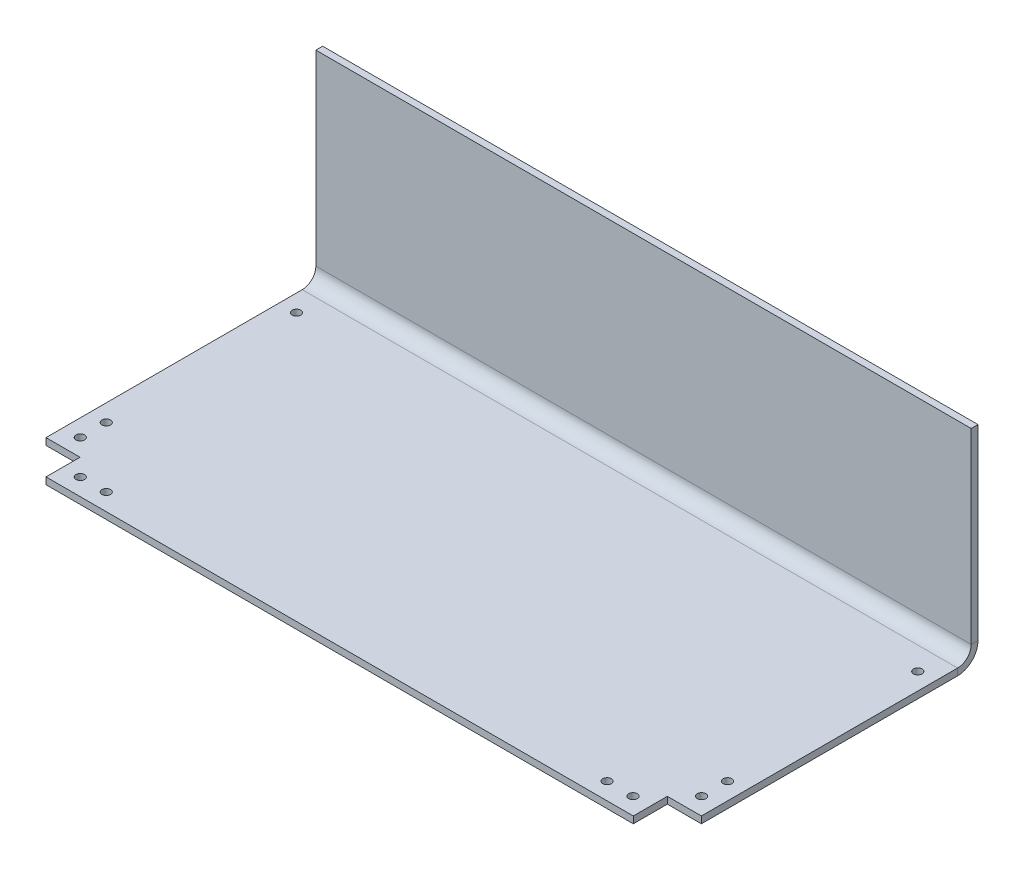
ISO-10303-21;
HEADER;
FILE_DESCRIPTION(('STEP AP214'),'2;1');
FILE_NAME('part.step','',(''),(''),'','','');
FILE_SCHEMA(('AUTOMOTIVE_DESIGN { 1 0 10303 214 1 1 1 1 }'));
ENDSEC;
DATA;
#1=APPLICATION_CONTEXT('core data for automotive mechanical design processes');
#2=APPLICATION_PROTOCOL_DEFINITION('international standard','automotive_design',2000,#1);
#3=PRODUCT_CONTEXT('',#1,'mechanical');
#4=PRODUCT('Part','Part','',(#3));
#5=PRODUCT_RELATED_PRODUCT_CATEGORY('part','',(#4));
#6=PRODUCT_DEFINITION_FORMATION('','',#4);
#7=PRODUCT_DEFINITION_CONTEXT('part definition',#1,'design');
#8=PRODUCT_DEFINITION('design','',#6,#7);
#9=PRODUCT_DEFINITION_SHAPE('','',#8);
#10=(LENGTH_UNIT() NAMED_UNIT(*) SI_UNIT(.MILLI.,.METRE.));
#11=(NAMED_UNIT(*) PLANE_ANGLE_UNIT() SI_UNIT($,.RADIAN.));
#12=(NAMED_UNIT(*) SI_UNIT($,.STERADIAN.) SOLID_ANGLE_UNIT());
#13=UNCERTAINTY_MEASURE_WITH_UNIT(LENGTH_MEASURE(1.E-05),#10,'distance_accuracy_value','');
#14=(GEOMETRIC_REPRESENTATION_CONTEXT(3) GLOBAL_UNCERTAINTY_ASSIGNED_CONTEXT((#13)) GLOBAL_UNIT_ASSIGNED_CONTEXT((#10,
#11,#12)) REPRESENTATION_CONTEXT('',''));
#15=CARTESIAN_POINT('',(0.,0.,0.));
#16=DIRECTION('',(0.,0.,1.));
#17=DIRECTION('',(1.,0.,0.));
#18=AXIS2_PLACEMENT_3D('',#15,#16,#17);
#19=CARTESIAN_POINT('',(0.,5.,228.2));
#20=DIRECTION('',(1.,0.,0.));
#21=DIRECTION('',(0.,0.,1.));
#22=AXIS2_PLACEMENT_3D('',#19,#20,#21);
#23=PLANE('',#22);
#24=DIRECTION('',(0.,0.,1.));
#25=VECTOR('',#24,1.);
#26=CARTESIAN_POINT('',(0.,5.,228.2));
#27=LINE('',#26,#25);
#28=CARTESIAN_POINT('',(0.,4.9999999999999,15.));
#29=VERTEX_POINT('',#28);
#30=CARTESIAN_POINT('',(0.,5.,203.2));
#31=VERTEX_POINT('',#30);
#32=EDGE_CURVE('E195',#29,#31,#27,.T.);
#33=ORIENTED_EDGE('',*,*,#32,.F.);
#34=DIRECTION('',(0.,-1.,0.));
#35=VECTOR('',#34,1.);
#36=CARTESIAN_POINT('',(0.,4.9999999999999,15.));
#37=LINE('',#36,#35);
#38=CARTESIAN_POINT('',(0.,-1.04083408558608E-13,15.));
#39=VERTEX_POINT('',#38);
#40=EDGE_CURVE('E319',#29,#39,#37,.T.);
#41=ORIENTED_EDGE('',*,*,#40,.T.);
#42=DIRECTION('',(0.,0.,-1.));
#43=VECTOR('',#42,1.);
#44=CARTESIAN_POINT('',(0.,0.,0.));
#45=LINE('',#44,#43);
#46=CARTESIAN_POINT('',(0.,0.,203.2));
#47=VERTEX_POINT('',#46);
#48=EDGE_CURVE('E262',#39,#47,#45,.F.);
#49=ORIENTED_EDGE('',*,*,#48,.T.);
#50=DIRECTION('',(0.,1.,0.));
#51=VECTOR('',#50,1.);
#52=CARTESIAN_POINT('',(0.,5.,203.2));
#53=LINE('',#52,#51);
#54=EDGE_CURVE('E80',#47,#31,#53,.T.);
#55=ORIENTED_EDGE('',*,*,#54,.T.);
#56=EDGE_LOOP('',(#33,#41,#49,#55));
#57=FACE_BOUND('',#56,.T.);
#58=ADVANCED_FACE('F71',(#57),#23,.F.);
#59=CARTESIAN_POINT('',(0.,5.,0.));
#60=DIRECTION('',(0.,-1.,0.));
#61=DIRECTION('',(0.,0.,-1.));
#62=AXIS2_PLACEMENT_3D('',#59,#60,#61);
#63=PLANE('',#62);
#64=CARTESIAN_POINT('',(56.75,5.,215.7));
#65=DIRECTION('',(0.,1.,0.));
#66=DIRECTION('',(0.,0.,-1.));
#67=AXIS2_PLACEMENT_3D('',#64,#65,#66);
#68=CIRCLE('',#67,3.17499999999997);
#69=CARTESIAN_POINT('',(56.75,5.,212.525));
#70=VERTEX_POINT('',#69);
#71=EDGE_CURVE('E289',#70,#70,#68,.T.);
#72=ORIENTED_EDGE('',*,*,#71,.F.);
#73=EDGE_LOOP('',(#72));
#74=FACE_BOUND('',#73,.T.);
#75=CARTESIAN_POINT('',(468.9,5.,31.75));
#76=DIRECTION('',(0.,1.,0.));
#77=DIRECTION('',(0.,0.,1.));
#78=AXIS2_PLACEMENT_3D('',#75,#76,#77);
#79=CIRCLE('',#78,3.17499999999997);
#80=CARTESIAN_POINT('',(468.9,5.,34.925));
#81=VERTEX_POINT('',#80);
#82=EDGE_CURVE('E351',#81,#81,#79,.T.);
#83=ORIENTED_EDGE('',*,*,#82,.F.);
#84=EDGE_LOOP('',(#83));
#85=FACE_BOUND('',#84,.T.);
#86=CARTESIAN_POINT('',(468.9,5.,190.5));
#87=DIRECTION('',(0.,1.,0.));
#88=DIRECTION('',(0.,0.,1.));
#89=AXIS2_PLACEMENT_3D('',#86,#87,#88);
#90=CIRCLE('',#89,3.17499999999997);
#91=CARTESIAN_POINT('',(468.9,5.,193.675));
#92=VERTEX_POINT('',#91);
#93=EDGE_CURVE('E347',#92,#92,#90,.T.);
#94=ORIENTED_EDGE('',*,*,#93,.F.);
#95=EDGE_LOOP('',(#94));
#96=FACE_BOUND('',#95,.T.);
#97=CARTESIAN_POINT('',(424.65,5.,215.7));
#98=DIRECTION('',(0.,1.,0.));
#99=DIRECTION('',(0.,0.,1.));
#100=AXIS2_PLACEMENT_3D('',#97,#98,#99);
#101=CIRCLE('',#100,3.17499999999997);
#102=CARTESIAN_POINT('',(424.65,5.,218.875));
#103=VERTEX_POINT('',#102);
#104=EDGE_CURVE('E343',#103,#103,#101,.T.);
#105=ORIENTED_EDGE('',*,*,#104,.F.);
#106=EDGE_LOOP('',(#105));
#107=FACE_BOUND('',#106,.T.);
#108=CARTESIAN_POINT('',(443.7,5.,215.7));
#109=DIRECTION('',(0.,1.,0.));
#110=DIRECTION('',(0.,0.,1.));
#111=AXIS2_PLACEMENT_3D('',#108,#109,#110);
#112=CIRCLE('',#111,3.17499999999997);
#113=CARTESIAN_POINT('',(443.7,5.,218.875));
#114=VERTEX_POINT('',#113);
#115=EDGE_CURVE('E339',#114,#114,#112,.T.);
#116=ORIENTED_EDGE('',*,*,#115,.F.);
#117=EDGE_LOOP('',(#116));
#118=FACE_BOUND('',#117,.T.);
#119=CARTESIAN_POINT('',(37.7,5.,215.7));
#120=DIRECTION('',(0.,1.,0.));
#121=DIRECTION('',(0.,0.,-1.));
#122=AXIS2_PLACEMENT_3D('',#119,#120,#121);
#123=CIRCLE('',#122,3.17499999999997);
#124=CARTESIAN_POINT('',(37.7,5.,212.525));
#125=VERTEX_POINT('',#124);
#126=EDGE_CURVE('E335',#125,#125,#123,.T.);
#127=ORIENTED_EDGE('',*,*,#126,.F.);
#128=EDGE_LOOP('',(#127));
#129=FACE_BOUND('',#128,.T.);
#130=CARTESIAN_POINT('',(12.5000000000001,5.,31.7499999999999));
#131=DIRECTION('',(0.,1.,0.));
#132=DIRECTION('',(0.,0.,-1.));
#133=AXIS2_PLACEMENT_3D('',#130,#131,#132);
#134=CIRCLE('',#133,3.17499999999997);
#135=CARTESIAN_POINT('',(12.5000000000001,5.,28.5749999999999));
#136=VERTEX_POINT('',#135);
#137=EDGE_CURVE('E331',#136,#136,#134,.T.);
#138=ORIENTED_EDGE('',*,*,#137,.F.);
#139=EDGE_LOOP('',(#138));
#140=FACE_BOUND('',#139,.T.);
#141=CARTESIAN_POINT('',(12.5,5.,171.45));
#142=DIRECTION('',(0.,1.,0.));
#143=DIRECTION('',(0.,0.,-1.));
#144=AXIS2_PLACEMENT_3D('',#141,#142,#143);
#145=CIRCLE('',#144,3.17499999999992);
#146=CARTESIAN_POINT('',(12.5,5.,168.275));
#147=VERTEX_POINT('',#146);
#148=EDGE_CURVE('E327',#147,#147,#145,.T.);
#149=ORIENTED_EDGE('',*,*,#148,.F.);
#150=EDGE_LOOP('',(#149));
#151=FACE_BOUND('',#150,.T.);
#152=CARTESIAN_POINT('',(12.5,5.,190.5));
#153=DIRECTION('',(0.,1.,0.));
#154=DIRECTION('',(0.,0.,-1.));
#155=AXIS2_PLACEMENT_3D('',#152,#153,#154);
#156=CIRCLE('',#155,3.17499999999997);
#157=CARTESIAN_POINT('',(12.5,5.,187.325));
#158=VERTEX_POINT('',#157);
#159=EDGE_CURVE('E323',#158,#158,#156,.T.);
#160=ORIENTED_EDGE('',*,*,#159,.F.);
#161=EDGE_LOOP('',(#160));
#162=FACE_BOUND('',#161,.T.);
#163=CARTESIAN_POINT('',(468.9,5.,171.45));
#164=DIRECTION('',(0.,1.,0.));
#165=DIRECTION('',(0.,0.,1.));
#166=AXIS2_PLACEMENT_3D('',#163,#164,#165);
#167=CIRCLE('',#166,3.17499999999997);
#168=CARTESIAN_POINT('',(468.9,5.,174.625));
#169=VERTEX_POINT('',#168);
#170=EDGE_CURVE('E257',#169,#169,#167,.T.);
#171=ORIENTED_EDGE('',*,*,#170,.F.);
#172=EDGE_LOOP('',(#171));
#173=FACE_BOUND('',#172,.T.);
#174=DIRECTION('',(-1.,0.,0.));
#175=VECTOR('',#174,1.);
#176=CARTESIAN_POINT('',(0.,4.9999999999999,15.));
#177=LINE('',#176,#175);
#178=CARTESIAN_POINT('',(481.4,4.9999999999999,15.));
#179=VERTEX_POINT('',#178);
#180=EDGE_CURVE('E303',#29,#179,#177,.F.);
#181=ORIENTED_EDGE('',*,*,#180,.F.);
#182=ORIENTED_EDGE('',*,*,#32,.T.);
#183=DIRECTION('',(-1.,0.,0.));
#184=VECTOR('',#183,1.);
#185=CARTESIAN_POINT('',(0.,5.,203.2));
#186=LINE('',#185,#184);
#187=CARTESIAN_POINT('',(25.,5.,203.2));
#188=VERTEX_POINT('',#187);
#189=EDGE_CURVE('E179',#188,#31,#186,.T.);
#190=ORIENTED_EDGE('',*,*,#189,.F.);
#191=DIRECTION('',(0.,0.,-1.));
#192=VECTOR('',#191,1.);
#193=CARTESIAN_POINT('',(25.,5.,203.2));
#194=LINE('',#193,#192);
#195=CARTESIAN_POINT('',(25.,5.,228.2));
#196=VERTEX_POINT('',#195);
#197=EDGE_CURVE('E193',#196,#188,#194,.T.);
#198=ORIENTED_EDGE('',*,*,#197,.F.);
#199=DIRECTION('',(1.,0.,0.));
#200=VECTOR('',#199,1.);
#201=CARTESIAN_POINT('',(481.4,5.,228.2));
#202=LINE('',#201,#200);
#203=CARTESIAN_POINT('',(456.4,5.,228.2));
#204=VERTEX_POINT('',#203);
#205=EDGE_CURVE('E201',#196,#204,#202,.T.);
#206=ORIENTED_EDGE('',*,*,#205,.T.);
#207=DIRECTION('',(0.,0.,1.));
#208=VECTOR('',#207,1.);
#209=CARTESIAN_POINT('',(456.4,5.,203.2));
#210=LINE('',#209,#208);
#211=CARTESIAN_POINT('',(456.4,5.,203.2));
#212=VERTEX_POINT('',#211);
#213=EDGE_CURVE('E283',#212,#204,#210,.T.);
#214=ORIENTED_EDGE('',*,*,#213,.F.);
#215=DIRECTION('',(-1.,0.,0.));
#216=VECTOR('',#215,1.);
#217=CARTESIAN_POINT('',(481.4,5.,203.2));
#218=LINE('',#217,#216);
#219=CARTESIAN_POINT('',(481.4,5.,203.2));
#220=VERTEX_POINT('',#219);
#221=EDGE_CURVE('E285',#220,#212,#218,.T.);
#222=ORIENTED_EDGE('',*,*,#221,.F.);
#223=DIRECTION('',(0.,0.,-1.));
#224=VECTOR('',#223,1.);
#225=CARTESIAN_POINT('',(481.4,5.,0.));
#226=LINE('',#225,#224);
#227=EDGE_CURVE('E292',#220,#179,#226,.T.);
#228=ORIENTED_EDGE('',*,*,#227,.T.);
#229=EDGE_LOOP('',(#181,#182,#190,#198,#206,#214,#222,#228));
#230=FACE_BOUND('',#229,.T.);
#231=ADVANCED_FACE('F191',(#74,#85,#96,#107,#118,#129,#140,#151,#162,#173,#230),#63,.F.);
#232=CARTESIAN_POINT('',(0.,0.,0.));
#233=DIRECTION('',(0.,-1.,0.));
#234=DIRECTION('',(0.,0.,-1.));
#235=AXIS2_PLACEMENT_3D('',#232,#233,#234);
#236=PLANE('',#235);
#237=CARTESIAN_POINT('',(468.9,0.,171.45));
#238=DIRECTION('',(0.,1.,0.));
#239=DIRECTION('',(0.,0.,1.));
#240=AXIS2_PLACEMENT_3D('',#237,#238,#239);
#241=CIRCLE('',#240,3.17499999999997);
#242=CARTESIAN_POINT('',(468.9,0.,174.625));
#243=VERTEX_POINT('',#242);
#244=EDGE_CURVE('E209',#243,#243,#241,.T.);
#245=ORIENTED_EDGE('',*,*,#244,.T.);
#246=EDGE_LOOP('',(#245));
#247=FACE_BOUND('',#246,.T.);
#248=CARTESIAN_POINT('',(12.5,0.,190.5));
#249=DIRECTION('',(0.,1.,0.));
#250=DIRECTION('',(0.,0.,1.));
#251=AXIS2_PLACEMENT_3D('',#248,#249,#250);
#252=CIRCLE('',#251,3.17499999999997);
#253=CARTESIAN_POINT('',(12.5,0.,193.675));
#254=VERTEX_POINT('',#253);
#255=EDGE_CURVE('E213',#254,#254,#252,.T.);
#256=ORIENTED_EDGE('',*,*,#255,.T.);
#257=EDGE_LOOP('',(#256));
#258=FACE_BOUND('',#257,.T.);
#259=CARTESIAN_POINT('',(12.5,0.,171.45));
#260=DIRECTION('',(0.,1.,0.));
#261=DIRECTION('',(0.,0.,1.));
#262=AXIS2_PLACEMENT_3D('',#259,#260,#261);
#263=CIRCLE('',#262,3.17499999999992);
#264=CARTESIAN_POINT('',(12.5,0.,174.625));
#265=VERTEX_POINT('',#264);
#266=EDGE_CURVE('E218',#265,#265,#263,.T.);
#267=ORIENTED_EDGE('',*,*,#266,.T.);
#268=EDGE_LOOP('',(#267));
#269=FACE_BOUND('',#268,.T.);
#270=CARTESIAN_POINT('',(12.5000000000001,0.,31.7499999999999));
#271=DIRECTION('',(0.,1.,0.));
#272=DIRECTION('',(0.,0.,1.));
#273=AXIS2_PLACEMENT_3D('',#270,#271,#272);
#274=CIRCLE('',#273,3.17499999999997);
#275=CARTESIAN_POINT('',(12.5000000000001,0.,34.9249999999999));
#276=VERTEX_POINT('',#275);
#277=EDGE_CURVE('E222',#276,#276,#274,.T.);
#278=ORIENTED_EDGE('',*,*,#277,.T.);
#279=EDGE_LOOP('',(#278));
#280=FACE_BOUND('',#279,.T.);
#281=CARTESIAN_POINT('',(37.7,0.,215.7));
#282=DIRECTION('',(0.,1.,0.));
#283=DIRECTION('',(0.,0.,1.));
#284=AXIS2_PLACEMENT_3D('',#281,#282,#283);
#285=CIRCLE('',#284,3.17499999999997);
#286=CARTESIAN_POINT('',(37.7,0.,218.875));
#287=VERTEX_POINT('',#286);
#288=EDGE_CURVE('E226',#287,#287,#285,.T.);
#289=ORIENTED_EDGE('',*,*,#288,.T.);
#290=EDGE_LOOP('',(#289));
#291=FACE_BOUND('',#290,.T.);
#292=CARTESIAN_POINT('',(443.7,0.,215.7));
#293=DIRECTION('',(0.,1.,0.));
#294=DIRECTION('',(0.,0.,1.));
#295=AXIS2_PLACEMENT_3D('',#292,#293,#294);
#296=CIRCLE('',#295,3.17499999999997);
#297=CARTESIAN_POINT('',(443.7,0.,218.875));
#298=VERTEX_POINT('',#297);
#299=EDGE_CURVE('E230',#298,#298,#296,.T.);
#300=ORIENTED_EDGE('',*,*,#299,.T.);
#301=EDGE_LOOP('',(#300));
#302=FACE_BOUND('',#301,.T.);
#303=CARTESIAN_POINT('',(424.65,0.,215.7));
#304=DIRECTION('',(0.,1.,0.));
#305=DIRECTION('',(0.,0.,1.));
#306=AXIS2_PLACEMENT_3D('',#303,#304,#305);
#307=CIRCLE('',#306,3.17499999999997);
#308=CARTESIAN_POINT('',(424.65,0.,218.875));
#309=VERTEX_POINT('',#308);
#310=EDGE_CURVE('E234',#309,#309,#307,.T.);
#311=ORIENTED_EDGE('',*,*,#310,.T.);
#312=EDGE_LOOP('',(#311));
#313=FACE_BOUND('',#312,.T.);
#314=CARTESIAN_POINT('',(468.9,0.,190.5));
#315=DIRECTION('',(0.,1.,0.));
#316=DIRECTION('',(0.,0.,1.));
#317=AXIS2_PLACEMENT_3D('',#314,#315,#316);
#318=CIRCLE('',#317,3.17499999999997);
#319=CARTESIAN_POINT('',(468.9,0.,193.675));
#320=VERTEX_POINT('',#319);
#321=EDGE_CURVE('E238',#320,#320,#318,.T.);
#322=ORIENTED_EDGE('',*,*,#321,.T.);
#323=EDGE_LOOP('',(#322));
#324=FACE_BOUND('',#323,.T.);
#325=CARTESIAN_POINT('',(468.9,0.,31.75));
#326=DIRECTION('',(0.,1.,0.));
#327=DIRECTION('',(0.,0.,1.));
#328=AXIS2_PLACEMENT_3D('',#325,#326,#327);
#329=CIRCLE('',#328,3.17499999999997);
#330=CARTESIAN_POINT('',(468.9,0.,34.925));
#331=VERTEX_POINT('',#330);
#332=EDGE_CURVE('E242',#331,#331,#329,.T.);
#333=ORIENTED_EDGE('',*,*,#332,.T.);
#334=EDGE_LOOP('',(#333));
#335=FACE_BOUND('',#334,.T.);
#336=CARTESIAN_POINT('',(56.75,0.,215.7));
#337=DIRECTION('',(0.,1.,0.));
#338=DIRECTION('',(0.,0.,1.));
#339=AXIS2_PLACEMENT_3D('',#336,#337,#338);
#340=CIRCLE('',#339,3.17499999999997);
#341=CARTESIAN_POINT('',(56.75,0.,218.875));
#342=VERTEX_POINT('',#341);
#343=EDGE_CURVE('E246',#342,#342,#340,.T.);
#344=ORIENTED_EDGE('',*,*,#343,.T.);
#345=EDGE_LOOP('',(#344));
#346=FACE_BOUND('',#345,.T.);
#347=ORIENTED_EDGE('',*,*,#48,.F.);
#348=DIRECTION('',(-1.,0.,0.));
#349=VECTOR('',#348,1.);
#350=CARTESIAN_POINT('',(0.,-1.04083408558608E-13,15.));
#351=LINE('',#350,#349);
#352=CARTESIAN_POINT('',(481.4,0.,15.));
#353=VERTEX_POINT('',#352);
#354=EDGE_CURVE('E142',#39,#353,#351,.F.);
#355=ORIENTED_EDGE('',*,*,#354,.T.);
#356=DIRECTION('',(0.,0.,-1.));
#357=VECTOR('',#356,1.);
#358=CARTESIAN_POINT('',(481.4,0.,0.));
#359=LINE('',#358,#357);
#360=CARTESIAN_POINT('',(481.4,0.,203.2));
#361=VERTEX_POINT('',#360);
#362=EDGE_CURVE('E265',#361,#353,#359,.T.);
#363=ORIENTED_EDGE('',*,*,#362,.F.);
#364=DIRECTION('',(1.,0.,0.));
#365=VECTOR('',#364,1.);
#366=CARTESIAN_POINT('',(0.,0.,203.2));
#367=LINE('',#366,#365);
#368=CARTESIAN_POINT('',(456.4,0.,203.2));
#369=VERTEX_POINT('',#368);
#370=EDGE_CURVE('E254',#361,#369,#367,.F.);
#371=ORIENTED_EDGE('',*,*,#370,.T.);
#372=DIRECTION('',(0.,0.,-1.));
#373=VECTOR('',#372,1.);
#374=CARTESIAN_POINT('',(456.4,0.,0.));
#375=LINE('',#374,#373);
#376=CARTESIAN_POINT('',(456.4,0.,228.2));
#377=VERTEX_POINT('',#376);
#378=EDGE_CURVE('E250',#369,#377,#375,.F.);
#379=ORIENTED_EDGE('',*,*,#378,.T.);
#380=DIRECTION('',(1.,0.,0.));
#381=VECTOR('',#380,1.);
#382=CARTESIAN_POINT('',(0.,0.,228.2));
#383=LINE('',#382,#381);
#384=CARTESIAN_POINT('',(25.,0.,228.2));
#385=VERTEX_POINT('',#384);
#386=EDGE_CURVE('E255',#385,#377,#383,.T.);
#387=ORIENTED_EDGE('',*,*,#386,.F.);
#388=DIRECTION('',(0.,0.,-1.));
#389=VECTOR('',#388,1.);
#390=CARTESIAN_POINT('',(25.,0.,0.));
#391=LINE('',#390,#389);
#392=CARTESIAN_POINT('',(25.,0.,203.2));
#393=VERTEX_POINT('',#392);
#394=EDGE_CURVE('E258',#385,#393,#391,.T.);
#395=ORIENTED_EDGE('',*,*,#394,.T.);
#396=DIRECTION('',(1.,0.,0.));
#397=VECTOR('',#396,1.);
#398=CARTESIAN_POINT('',(0.,0.,203.2));
#399=LINE('',#398,#397);
#400=EDGE_CURVE('E181',#393,#47,#399,.F.);
#401=ORIENTED_EDGE('',*,*,#400,.T.);
#402=EDGE_LOOP('',(#347,#355,#363,#371,#379,#387,#395,#401));
#403=FACE_BOUND('',#402,.T.);
#404=ADVANCED_FACE('F277',(#247,#258,#269,#280,#291,#302,#313,#324,#335,#346,#403),#236,.T.);
#405=CARTESIAN_POINT('',(481.4,5.,0.));
#406=DIRECTION('',(-1.,0.,0.));
#407=DIRECTION('',(0.,0.,-1.));
#408=AXIS2_PLACEMENT_3D('',#405,#406,#407);
#409=PLANE('',#408);
#410=DIRECTION('',(0.,-1.,0.));
#411=VECTOR('',#410,1.);
#412=CARTESIAN_POINT('',(481.4,4.9999999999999,15.));
#413=LINE('',#412,#411);
#414=EDGE_CURVE('E214',#179,#353,#413,.T.);
#415=ORIENTED_EDGE('',*,*,#414,.F.);
#416=ORIENTED_EDGE('',*,*,#227,.F.);
#417=DIRECTION('',(0.,1.,0.));
#418=VECTOR('',#417,1.);
#419=CARTESIAN_POINT('',(481.4,5.,203.2));
#420=LINE('',#419,#418);
#421=EDGE_CURVE('E13',#361,#220,#420,.T.);
#422=ORIENTED_EDGE('',*,*,#421,.F.);
#423=ORIENTED_EDGE('',*,*,#362,.T.);
#424=EDGE_LOOP('',(#415,#416,#422,#423));
#425=FACE_BOUND('',#424,.T.);
#426=ADVANCED_FACE('F392',(#425),#409,.F.);
#427=CARTESIAN_POINT('',(0.,5.,203.2));
#428=DIRECTION('',(0.,0.,1.));
#429=DIRECTION('',(-1.,0.,0.));
#430=AXIS2_PLACEMENT_3D('',#427,#428,#429);
#431=PLANE('',#430);
#432=ORIENTED_EDGE('',*,*,#54,.F.);
#433=ORIENTED_EDGE('',*,*,#400,.F.);
#434=DIRECTION('',(0.,1.,0.));
#435=VECTOR('',#434,1.);
#436=CARTESIAN_POINT('',(25.,5.,203.2));
#437=LINE('',#436,#435);
#438=EDGE_CURVE('E175',#393,#188,#437,.T.);
#439=ORIENTED_EDGE('',*,*,#438,.T.);
#440=ORIENTED_EDGE('',*,*,#189,.T.);
#441=EDGE_LOOP('',(#432,#433,#439,#440));
#442=FACE_BOUND('',#441,.T.);
#443=ADVANCED_FACE('F178',(#442),#431,.T.);
#444=CARTESIAN_POINT('',(25.,5.,203.2));
#445=DIRECTION('',(-1.,0.,0.));
#446=DIRECTION('',(0.,0.,-1.));
#447=AXIS2_PLACEMENT_3D('',#444,#445,#446);
#448=PLANE('',#447);
#449=ORIENTED_EDGE('',*,*,#438,.F.);
#450=ORIENTED_EDGE('',*,*,#394,.F.);
#451=DIRECTION('',(0.,1.,0.));
#452=VECTOR('',#451,1.);
#453=CARTESIAN_POINT('',(25.,5.,228.2));
#454=LINE('',#453,#452);
#455=EDGE_CURVE('E186',#385,#196,#454,.T.);
#456=ORIENTED_EDGE('',*,*,#455,.T.);
#457=ORIENTED_EDGE('',*,*,#197,.T.);
#458=EDGE_LOOP('',(#449,#450,#456,#457));
#459=FACE_BOUND('',#458,.T.);
#460=ADVANCED_FACE('F199',(#459),#448,.T.);
#461=CARTESIAN_POINT('',(481.4,5.,228.2));
#462=DIRECTION('',(0.,0.,-1.));
#463=DIRECTION('',(1.,0.,0.));
#464=AXIS2_PLACEMENT_3D('',#461,#462,#463);
#465=PLANE('',#464);
#466=ORIENTED_EDGE('',*,*,#455,.F.);
#467=ORIENTED_EDGE('',*,*,#386,.T.);
#468=DIRECTION('',(0.,1.,0.));
#469=VECTOR('',#468,1.);
#470=CARTESIAN_POINT('',(456.4,5.,228.2));
#471=LINE('',#470,#469);
#472=EDGE_CURVE('E102',#377,#204,#471,.T.);
#473=ORIENTED_EDGE('',*,*,#472,.T.);
#474=ORIENTED_EDGE('',*,*,#205,.F.);
#475=EDGE_LOOP('',(#466,#467,#473,#474));
#476=FACE_BOUND('',#475,.T.);
#477=ADVANCED_FACE('F280',(#476),#465,.F.);
#478=CARTESIAN_POINT('',(456.4,5.,203.2));
#479=DIRECTION('',(1.,0.,0.));
#480=DIRECTION('',(0.,0.,1.));
#481=AXIS2_PLACEMENT_3D('',#478,#479,#480);
#482=PLANE('',#481);
#483=ORIENTED_EDGE('',*,*,#472,.F.);
#484=ORIENTED_EDGE('',*,*,#378,.F.);
#485=DIRECTION('',(0.,1.,0.));
#486=VECTOR('',#485,1.);
#487=CARTESIAN_POINT('',(456.4,5.,203.2));
#488=LINE('',#487,#486);
#489=EDGE_CURVE('E75',#369,#212,#488,.T.);
#490=ORIENTED_EDGE('',*,*,#489,.T.);
#491=ORIENTED_EDGE('',*,*,#213,.T.);
#492=EDGE_LOOP('',(#483,#484,#490,#491));
#493=FACE_BOUND('',#492,.T.);
#494=ADVANCED_FACE('F386',(#493),#482,.T.);
#495=CARTESIAN_POINT('',(468.9,5.,171.45));
#496=DIRECTION('',(0.,-1.,0.));
#497=DIRECTION('',(0.,0.,-1.));
#498=AXIS2_PLACEMENT_3D('',#495,#496,#497);
#499=CYLINDRICAL_SURFACE('',#498,3.17499999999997);
#500=ORIENTED_EDGE('',*,*,#170,.T.);
#501=EDGE_LOOP('',(#500));
#502=FACE_BOUND('',#501,.T.);
#503=ORIENTED_EDGE('',*,*,#244,.F.);
#504=EDGE_LOOP('',(#503));
#505=FACE_BOUND('',#504,.T.);
#506=ADVANCED_FACE('F382',(#502,#505),#499,.F.);
#507=CARTESIAN_POINT('',(12.5,5.,190.5));
#508=DIRECTION('',(0.,-1.,0.));
#509=DIRECTION('',(0.,0.,-1.));
#510=AXIS2_PLACEMENT_3D('',#507,#508,#509);
#511=CYLINDRICAL_SURFACE('',#510,3.17499999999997);
#512=ORIENTED_EDGE('',*,*,#159,.T.);
#513=EDGE_LOOP('',(#512));
#514=FACE_BOUND('',#513,.T.);
#515=ORIENTED_EDGE('',*,*,#255,.F.);
#516=EDGE_LOOP('',(#515));
#517=FACE_BOUND('',#516,.T.);
#518=ADVANCED_FACE('F385',(#514,#517),#511,.F.);
#519=CARTESIAN_POINT('',(12.5,5.,171.45));
#520=DIRECTION('',(0.,-1.,0.));
#521=DIRECTION('',(0.,0.,-1.));
#522=AXIS2_PLACEMENT_3D('',#519,#520,#521);
#523=CYLINDRICAL_SURFACE('',#522,3.17499999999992);
#524=ORIENTED_EDGE('',*,*,#148,.T.);
#525=EDGE_LOOP('',(#524));
#526=FACE_BOUND('',#525,.T.);
#527=ORIENTED_EDGE('',*,*,#266,.F.);
#528=EDGE_LOOP('',(#527));
#529=FACE_BOUND('',#528,.T.);
#530=ADVANCED_FACE('F465',(#526,#529),#523,.F.);
#531=CARTESIAN_POINT('',(12.5000000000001,5.,31.7499999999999));
#532=DIRECTION('',(0.,-1.,0.));
#533=DIRECTION('',(0.,0.,-1.));
#534=AXIS2_PLACEMENT_3D('',#531,#532,#533);
#535=CYLINDRICAL_SURFACE('',#534,3.17499999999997);
#536=ORIENTED_EDGE('',*,*,#137,.T.);
#537=EDGE_LOOP('',(#536));
#538=FACE_BOUND('',#537,.T.);
#539=ORIENTED_EDGE('',*,*,#277,.F.);
#540=EDGE_LOOP('',(#539));
#541=FACE_BOUND('',#540,.T.);
#542=ADVANCED_FACE('F474',(#538,#541),#535,.F.);
#543=CARTESIAN_POINT('',(37.7,5.,215.7));
#544=DIRECTION('',(0.,-1.,0.));
#545=DIRECTION('',(0.,0.,-1.));
#546=AXIS2_PLACEMENT_3D('',#543,#544,#545);
#547=CYLINDRICAL_SURFACE('',#546,3.17499999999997);
#548=ORIENTED_EDGE('',*,*,#126,.T.);
#549=EDGE_LOOP('',(#548));
#550=FACE_BOUND('',#549,.T.);
#551=ORIENTED_EDGE('',*,*,#288,.F.);
#552=EDGE_LOOP('',(#551));
#553=FACE_BOUND('',#552,.T.);
#554=ADVANCED_FACE('F483',(#550,#553),#547,.F.);
#555=CARTESIAN_POINT('',(443.7,5.,215.7));
#556=DIRECTION('',(0.,-1.,0.));
#557=DIRECTION('',(0.,0.,-1.));
#558=AXIS2_PLACEMENT_3D('',#555,#556,#557);
#559=CYLINDRICAL_SURFACE('',#558,3.17499999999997);
#560=ORIENTED_EDGE('',*,*,#115,.T.);
#561=EDGE_LOOP('',(#560));
#562=FACE_BOUND('',#561,.T.);
#563=ORIENTED_EDGE('',*,*,#299,.F.);
#564=EDGE_LOOP('',(#563));
#565=FACE_BOUND('',#564,.T.);
#566=ADVANCED_FACE('F492',(#562,#565),#559,.F.);
#567=CARTESIAN_POINT('',(424.65,5.,215.7));
#568=DIRECTION('',(0.,-1.,0.));
#569=DIRECTION('',(0.,0.,-1.));
#570=AXIS2_PLACEMENT_3D('',#567,#568,#569);
#571=CYLINDRICAL_SURFACE('',#570,3.17499999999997);
#572=ORIENTED_EDGE('',*,*,#104,.T.);
#573=EDGE_LOOP('',(#572));
#574=FACE_BOUND('',#573,.T.);
#575=ORIENTED_EDGE('',*,*,#310,.F.);
#576=EDGE_LOOP('',(#575));
#577=FACE_BOUND('',#576,.T.);
#578=ADVANCED_FACE('F501',(#574,#577),#571,.F.);
#579=CARTESIAN_POINT('',(468.9,5.,190.5));
#580=DIRECTION('',(0.,-1.,0.));
#581=DIRECTION('',(0.,0.,-1.));
#582=AXIS2_PLACEMENT_3D('',#579,#580,#581);
#583=CYLINDRICAL_SURFACE('',#582,3.17499999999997);
#584=ORIENTED_EDGE('',*,*,#93,.T.);
#585=EDGE_LOOP('',(#584));
#586=FACE_BOUND('',#585,.T.);
#587=ORIENTED_EDGE('',*,*,#321,.F.);
#588=EDGE_LOOP('',(#587));
#589=FACE_BOUND('',#588,.T.);
#590=ADVANCED_FACE('F419',(#586,#589),#583,.F.);
#591=CARTESIAN_POINT('',(468.9,5.,31.75));
#592=DIRECTION('',(0.,-1.,0.));
#593=DIRECTION('',(0.,0.,-1.));
#594=AXIS2_PLACEMENT_3D('',#591,#592,#593);
#595=CYLINDRICAL_SURFACE('',#594,3.17499999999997);
#596=ORIENTED_EDGE('',*,*,#82,.T.);
#597=EDGE_LOOP('',(#596));
#598=FACE_BOUND('',#597,.T.);
#599=ORIENTED_EDGE('',*,*,#332,.F.);
#600=EDGE_LOOP('',(#599));
#601=FACE_BOUND('',#600,.T.);
#602=ADVANCED_FACE('F412',(#598,#601),#595,.F.);
#603=CARTESIAN_POINT('',(56.75,5.,215.7));
#604=DIRECTION('',(0.,-1.,0.));
#605=DIRECTION('',(0.,0.,-1.));
#606=AXIS2_PLACEMENT_3D('',#603,#604,#605);
#607=CYLINDRICAL_SURFACE('',#606,3.17499999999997);
#608=ORIENTED_EDGE('',*,*,#71,.T.);
#609=EDGE_LOOP('',(#608));
#610=FACE_BOUND('',#609,.T.);
#611=ORIENTED_EDGE('',*,*,#343,.F.);
#612=EDGE_LOOP('',(#611));
#613=FACE_BOUND('',#612,.T.);
#614=ADVANCED_FACE('F358',(#610,#613),#607,.F.);
#615=CARTESIAN_POINT('',(481.4,5.,203.2));
#616=DIRECTION('',(0.,0.,1.));
#617=DIRECTION('',(-1.,0.,0.));
#618=AXIS2_PLACEMENT_3D('',#615,#616,#617);
#619=PLANE('',#618);
#620=ORIENTED_EDGE('',*,*,#370,.F.);
#621=ORIENTED_EDGE('',*,*,#421,.T.);
#622=ORIENTED_EDGE('',*,*,#221,.T.);
#623=ORIENTED_EDGE('',*,*,#489,.F.);
#624=EDGE_LOOP('',(#620,#621,#622,#623));
#625=FACE_BOUND('',#624,.T.);
#626=ADVANCED_FACE('F73',(#625),#619,.T.);
#627=CARTESIAN_POINT('',(481.4,14.9999999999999,15.));
#628=DIRECTION('',(1.,0.,0.));
#629=DIRECTION('',(0.,0.,-1.));
#630=AXIS2_PLACEMENT_3D('',#627,#628,#629);
#631=PLANE('',#630);
#632=DIRECTION('',(0.,0.,1.));
#633=VECTOR('',#632,1.);
#634=CARTESIAN_POINT('',(481.4,15.,0.));
#635=LINE('',#634,#633);
#636=CARTESIAN_POINT('',(481.4,14.9999999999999,4.99999999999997));
#637=VERTEX_POINT('',#636);
#638=CARTESIAN_POINT('',(481.4,14.9999999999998,0.));
#639=VERTEX_POINT('',#638);
#640=EDGE_CURVE('E901',#637,#639,#635,.F.);
#641=ORIENTED_EDGE('',*,*,#640,.F.);
#642=CARTESIAN_POINT('',(481.4,14.9999999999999,15.));
#643=DIRECTION('',(-1.,0.,0.));
#644=DIRECTION('',(0.,0.,1.));
#645=AXIS2_PLACEMENT_3D('',#642,#643,#644);
#646=CIRCLE('',#645,10.);
#647=EDGE_CURVE('E304',#179,#637,#646,.F.);
#648=ORIENTED_EDGE('',*,*,#647,.F.);
#649=ORIENTED_EDGE('',*,*,#414,.T.);
#650=CARTESIAN_POINT('',(481.4,14.9999999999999,15.));
#651=DIRECTION('',(-1.,0.,0.));
#652=DIRECTION('',(0.,0.,1.));
#653=AXIS2_PLACEMENT_3D('',#650,#651,#652);
#654=CIRCLE('',#653,15.);
#655=EDGE_CURVE('E90',#353,#639,#654,.F.);
#656=ORIENTED_EDGE('',*,*,#655,.T.);
#657=EDGE_LOOP('',(#641,#648,#649,#656));
#658=FACE_BOUND('',#657,.T.);
#659=ADVANCED_FACE('F418',(#658),#631,.T.);
#660=CARTESIAN_POINT('',(0.,14.9999999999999,15.));
#661=DIRECTION('',(1.,0.,0.));
#662=DIRECTION('',(0.,0.,-1.));
#663=AXIS2_PLACEMENT_3D('',#660,#661,#662);
#664=PLANE('',#663);
#665=CARTESIAN_POINT('',(0.,14.9999999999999,15.));
#666=DIRECTION('',(-1.,0.,0.));
#667=DIRECTION('',(0.,0.,1.));
#668=AXIS2_PLACEMENT_3D('',#665,#666,#667);
#669=CIRCLE('',#668,10.);
#670=CARTESIAN_POINT('',(0.,14.9999999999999,4.99999999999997));
#671=VERTEX_POINT('',#670);
#672=EDGE_CURVE('E305',#671,#29,#669,.T.);
#673=ORIENTED_EDGE('',*,*,#672,.F.);
#674=DIRECTION('',(0.,0.,1.));
#675=VECTOR('',#674,1.);
#676=CARTESIAN_POINT('',(0.,15.,4.99999999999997));
#677=LINE('',#676,#675);
#678=CARTESIAN_POINT('',(0.,15.,0.));
#679=VERTEX_POINT('',#678);
#680=EDGE_CURVE('E896',#671,#679,#677,.F.);
#681=ORIENTED_EDGE('',*,*,#680,.T.);
#682=CARTESIAN_POINT('',(0.,14.9999999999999,15.));
#683=DIRECTION('',(-1.,0.,0.));
#684=DIRECTION('',(0.,0.,1.));
#685=AXIS2_PLACEMENT_3D('',#682,#683,#684);
#686=CIRCLE('',#685,15.);
#687=EDGE_CURVE('E301',#679,#39,#686,.T.);
#688=ORIENTED_EDGE('',*,*,#687,.T.);
#689=ORIENTED_EDGE('',*,*,#40,.F.);
#690=EDGE_LOOP('',(#673,#681,#688,#689));
#691=FACE_BOUND('',#690,.T.);
#692=ADVANCED_FACE('F541',(#691),#664,.F.);
#693=CARTESIAN_POINT('',(0.,14.9999999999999,15.));
#694=DIRECTION('',(-1.,0.,0.));
#695=DIRECTION('',(0.,0.,-1.));
#696=AXIS2_PLACEMENT_3D('',#693,#694,#695);
#697=CYLINDRICAL_SURFACE('',#696,15.);
#698=ORIENTED_EDGE('',*,*,#354,.F.);
#699=ORIENTED_EDGE('',*,*,#687,.F.);
#700=DIRECTION('',(-1.,0.,0.));
#701=VECTOR('',#700,1.);
#702=CARTESIAN_POINT('',(481.4,15.,0.));
#703=LINE('',#702,#701);
#704=EDGE_CURVE('E893',#679,#639,#703,.F.);
#705=ORIENTED_EDGE('',*,*,#704,.T.);
#706=ORIENTED_EDGE('',*,*,#655,.F.);
#707=EDGE_LOOP('',(#698,#699,#705,#706));
#708=FACE_BOUND('',#707,.T.);
#709=ADVANCED_FACE('F550',(#708),#697,.T.);
#710=CARTESIAN_POINT('',(0.,14.9999999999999,15.));
#711=DIRECTION('',(-1.,0.,0.));
#712=DIRECTION('',(0.,0.,-1.));
#713=AXIS2_PLACEMENT_3D('',#710,#711,#712);
#714=CYLINDRICAL_SURFACE('',#713,10.);
#715=ORIENTED_EDGE('',*,*,#180,.T.);
#716=ORIENTED_EDGE('',*,*,#647,.T.);
#717=DIRECTION('',(-1.,0.,0.));
#718=VECTOR('',#717,1.);
#719=CARTESIAN_POINT('',(481.4,15.,4.99999999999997));
#720=LINE('',#719,#718);
#721=EDGE_CURVE('E879',#637,#671,#720,.T.);
#722=ORIENTED_EDGE('',*,*,#721,.T.);
#723=ORIENTED_EDGE('',*,*,#672,.T.);
#724=EDGE_LOOP('',(#715,#716,#722,#723));
#725=FACE_BOUND('',#724,.T.);
#726=ADVANCED_FACE('F559',(#725),#714,.F.);
#727=CARTESIAN_POINT('',(0.,152.4,-5.14345510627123E-13));
#728=DIRECTION('',(1.,0.,0.));
#729=DIRECTION('',(0.,0.,-1.));
#730=AXIS2_PLACEMENT_3D('',#727,#728,#729);
#731=PLANE('',#730);
#732=ORIENTED_EDGE('',*,*,#680,.F.);
#733=DIRECTION('',(0.,-1.,0.));
#734=VECTOR('',#733,1.);
#735=CARTESIAN_POINT('',(0.,152.4,4.99999999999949));
#736=LINE('',#735,#734);
#737=CARTESIAN_POINT('',(0.,152.4,4.99999999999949));
#738=VERTEX_POINT('',#737);
#739=EDGE_CURVE('E872',#671,#738,#736,.F.);
#740=ORIENTED_EDGE('',*,*,#739,.T.);
#741=DIRECTION('',(0.,0.,1.));
#742=VECTOR('',#741,1.);
#743=CARTESIAN_POINT('',(0.,152.4,-5.14345510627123E-13));
#744=LINE('',#743,#742);
#745=CARTESIAN_POINT('',(0.,152.4,-5.14754521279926E-13));
#746=VERTEX_POINT('',#745);
#747=EDGE_CURVE('E314',#746,#738,#744,.T.);
#748=ORIENTED_EDGE('',*,*,#747,.F.);
#749=DIRECTION('',(0.,1.,0.));
#750=VECTOR('',#749,1.);
#751=CARTESIAN_POINT('',(0.,0.,0.));
#752=LINE('',#751,#750);
#753=EDGE_CURVE('E881',#679,#746,#752,.T.);
#754=ORIENTED_EDGE('',*,*,#753,.F.);
#755=EDGE_LOOP('',(#732,#740,#748,#754));
#756=FACE_BOUND('',#755,.T.);
#757=ADVANCED_FACE('F567',(#756),#731,.F.);
#758=CARTESIAN_POINT('',(481.4,4.99999999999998,0.));
#759=DIRECTION('',(-1.,0.,0.));
#760=DIRECTION('',(0.,0.,1.));
#761=AXIS2_PLACEMENT_3D('',#758,#759,#760);
#762=PLANE('',#761);
#763=ORIENTED_EDGE('',*,*,#640,.T.);
#764=DIRECTION('',(0.,-1.,0.));
#765=VECTOR('',#764,1.);
#766=CARTESIAN_POINT('',(481.4,0.,0.));
#767=LINE('',#766,#765);
#768=CARTESIAN_POINT('',(481.4,152.4,-5.14754521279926E-13));
#769=VERTEX_POINT('',#768);
#770=EDGE_CURVE('E876',#769,#639,#767,.T.);
#771=ORIENTED_EDGE('',*,*,#770,.F.);
#772=DIRECTION('',(0.,0.,1.));
#773=VECTOR('',#772,1.);
#774=CARTESIAN_POINT('',(481.4,152.4,-5.14644349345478E-13));
#775=LINE('',#774,#773);
#776=CARTESIAN_POINT('',(481.4,152.4,4.99999999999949));
#777=VERTEX_POINT('',#776);
#778=EDGE_CURVE('E861',#769,#777,#775,.T.);
#779=ORIENTED_EDGE('',*,*,#778,.T.);
#780=DIRECTION('',(0.,1.,0.));
#781=VECTOR('',#780,1.);
#782=CARTESIAN_POINT('',(481.4,5.,5.));
#783=LINE('',#782,#781);
#784=EDGE_CURVE('E871',#777,#637,#783,.F.);
#785=ORIENTED_EDGE('',*,*,#784,.T.);
#786=EDGE_LOOP('',(#763,#771,#779,#785));
#787=FACE_BOUND('',#786,.T.);
#788=ADVANCED_FACE('F576',(#787),#762,.F.);
#789=CARTESIAN_POINT('',(0.,0.,0.));
#790=DIRECTION('',(0.,0.,1.));
#791=DIRECTION('',(0.,-1.,0.));
#792=AXIS2_PLACEMENT_3D('',#789,#790,#791);
#793=PLANE('',#792);
#794=ORIENTED_EDGE('',*,*,#704,.F.);
#795=ORIENTED_EDGE('',*,*,#753,.T.);
#796=DIRECTION('',(1.,0.,0.));
#797=VECTOR('',#796,1.);
#798=CARTESIAN_POINT('',(0.,152.4,-5.14754521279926E-13));
#799=LINE('',#798,#797);
#800=EDGE_CURVE('E886',#746,#769,#799,.T.);
#801=ORIENTED_EDGE('',*,*,#800,.T.);
#802=ORIENTED_EDGE('',*,*,#770,.T.);
#803=EDGE_LOOP('',(#794,#795,#801,#802));
#804=FACE_BOUND('',#803,.T.);
#805=ADVANCED_FACE('F585',(#804),#793,.F.);
#806=CARTESIAN_POINT('',(0.,0.,5.00000000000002));
#807=DIRECTION('',(0.,0.,1.));
#808=DIRECTION('',(0.,-1.,0.));
#809=AXIS2_PLACEMENT_3D('',#806,#807,#808);
#810=PLANE('',#809);
#811=ORIENTED_EDGE('',*,*,#739,.F.);
#812=ORIENTED_EDGE('',*,*,#721,.F.);
#813=ORIENTED_EDGE('',*,*,#784,.F.);
#814=DIRECTION('',(-1.,0.,0.));
#815=VECTOR('',#814,1.);
#816=CARTESIAN_POINT('',(481.4,152.4,4.99999999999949));
#817=LINE('',#816,#815);
#818=EDGE_CURVE('E858',#738,#777,#817,.F.);
#819=ORIENTED_EDGE('',*,*,#818,.F.);
#820=EDGE_LOOP('',(#811,#812,#813,#819));
#821=FACE_BOUND('',#820,.T.);
#822=ADVANCED_FACE('F593',(#821),#810,.T.);
#823=CARTESIAN_POINT('',(481.4,152.4,-5.14345510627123E-13));
#824=DIRECTION('',(0.,-1.,0.));
#825=DIRECTION('',(0.,0.,-1.));
#826=AXIS2_PLACEMENT_3D('',#823,#824,#825);
#827=PLANE('',#826);
#828=ORIENTED_EDGE('',*,*,#818,.T.);
#829=ORIENTED_EDGE('',*,*,#778,.F.);
#830=ORIENTED_EDGE('',*,*,#800,.F.);
#831=ORIENTED_EDGE('',*,*,#747,.T.);
#832=EDGE_LOOP('',(#828,#829,#830,#831));
#833=FACE_BOUND('',#832,.T.);
#834=ADVANCED_FACE('F601',(#833),#827,.F.);
#835=CLOSED_SHELL('',(#58,#231,#404,#426,#443,#460,#477,#494,#506,#518,#530,#542,#554,#566,#578,
#590,#602,#614,#626,#659,#692,#709,#726,#757,#788,#805,#822,#834));
#836=MANIFOLD_SOLID_BREP('B2',#835);
#837=ADVANCED_BREP_SHAPE_REPRESENTATION('',(#18,#836),#14);
#838=SHAPE_DEFINITION_REPRESENTATION(#9,#837);
ENDSEC;
END-ISO-10303-21;
